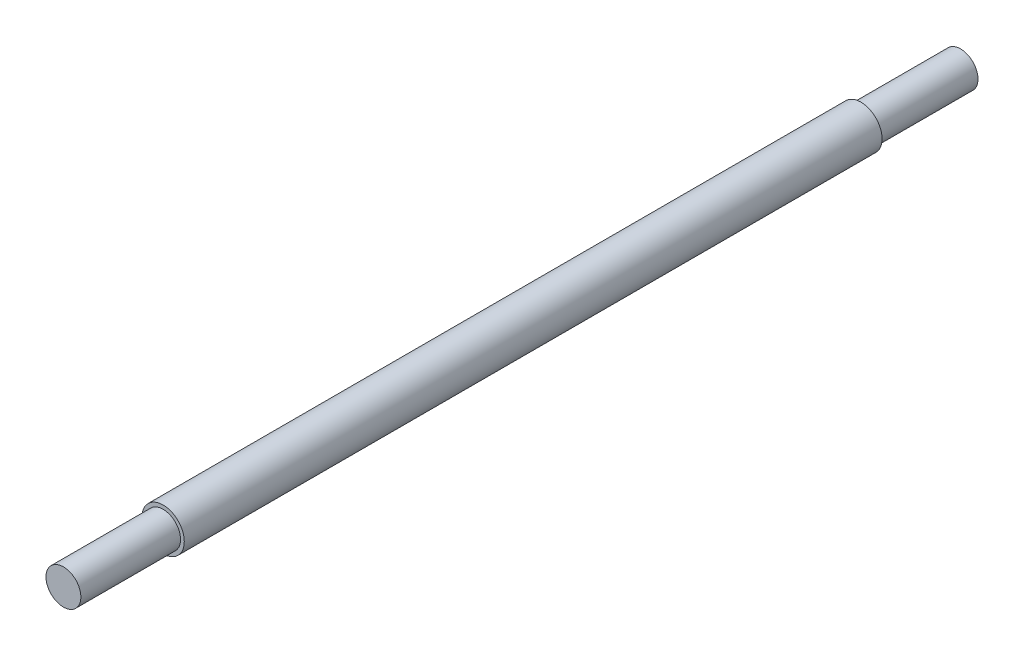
from build123d import *

# Parameters (mm, degrees)
SKETCH1_R           = 42.5
BASE_EXTRUDE_DEPTH  = 700
SKETCH2_R           = 35
BOSS_EXTRUDE1_DEPTH = 900


with BuildPart() as part:
    # Sketch1 → Base-Extrude (new, symmetric)
    with BuildSketch(Plane.XY):
        Circle(SKETCH1_R)
    extrude(amount=BASE_EXTRUDE_DEPTH, both=True)

    # Sketch2 → Boss-Extrude1 (add, symmetric)
    with BuildSketch(Plane.XY):
        Circle(SKETCH2_R)
    extrude(amount=BOSS_EXTRUDE1_DEPTH, both=True)


solid = part.part
